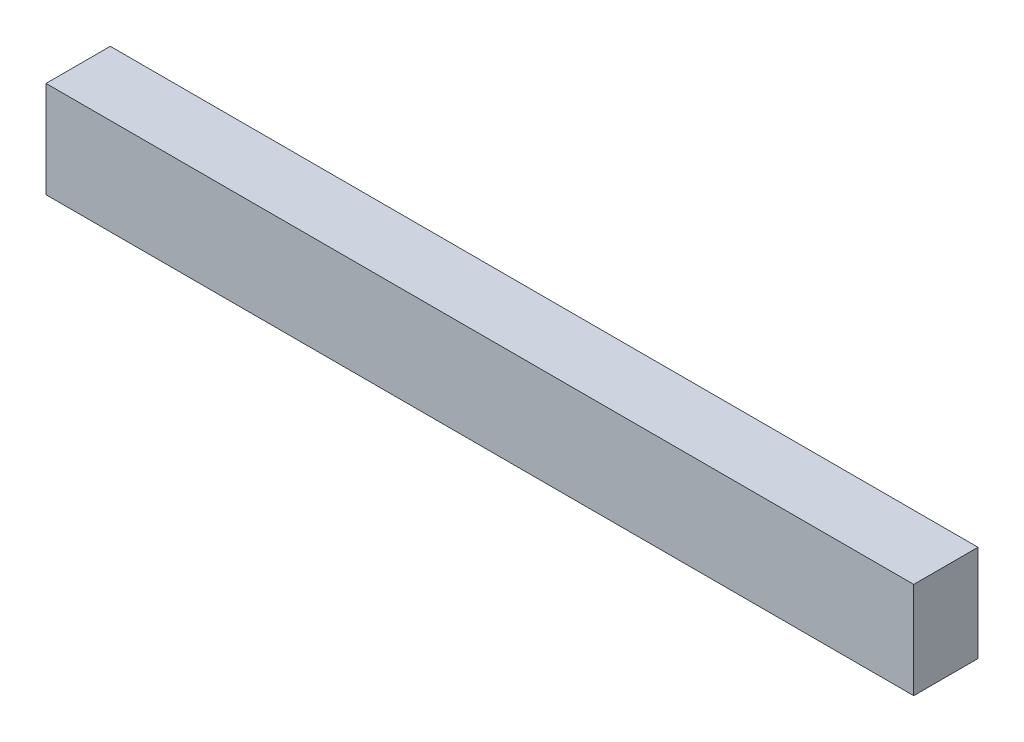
ISO-10303-21;
HEADER;
FILE_DESCRIPTION(('STEP AP214'),'2;1');
FILE_NAME('part.step','',(''),(''),'','','');
FILE_SCHEMA(('AUTOMOTIVE_DESIGN { 1 0 10303 214 1 1 1 1 }'));
ENDSEC;
DATA;
#1=APPLICATION_CONTEXT('core data for automotive mechanical design processes');
#2=APPLICATION_PROTOCOL_DEFINITION('international standard','automotive_design',2000,#1);
#3=PRODUCT_CONTEXT('',#1,'mechanical');
#4=PRODUCT('Part','Part','',(#3));
#5=PRODUCT_RELATED_PRODUCT_CATEGORY('part','',(#4));
#6=PRODUCT_DEFINITION_FORMATION('','',#4);
#7=PRODUCT_DEFINITION_CONTEXT('part definition',#1,'design');
#8=PRODUCT_DEFINITION('design','',#6,#7);
#9=PRODUCT_DEFINITION_SHAPE('','',#8);
#10=(LENGTH_UNIT() NAMED_UNIT(*) SI_UNIT(.MILLI.,.METRE.));
#11=(NAMED_UNIT(*) PLANE_ANGLE_UNIT() SI_UNIT($,.RADIAN.));
#12=(NAMED_UNIT(*) SI_UNIT($,.STERADIAN.) SOLID_ANGLE_UNIT());
#13=UNCERTAINTY_MEASURE_WITH_UNIT(LENGTH_MEASURE(1.E-05),#10,'distance_accuracy_value','');
#14=(GEOMETRIC_REPRESENTATION_CONTEXT(3) GLOBAL_UNCERTAINTY_ASSIGNED_CONTEXT((#13)) GLOBAL_UNIT_ASSIGNED_CONTEXT((#10,
#11,#12)) REPRESENTATION_CONTEXT('',''));
#15=CARTESIAN_POINT('',(0.,0.,0.));
#16=DIRECTION('',(0.,0.,1.));
#17=DIRECTION('',(1.,0.,0.));
#18=AXIS2_PLACEMENT_3D('',#15,#16,#17);
#19=CARTESIAN_POINT('',(270.,0.,0.));
#20=DIRECTION('',(0.,0.,-1.));
#21=DIRECTION('',(-1.,0.,0.));
#22=AXIS2_PLACEMENT_3D('',#19,#20,#21);
#23=PLANE('',#22);
#24=DIRECTION('',(0.,-1.,0.));
#25=VECTOR('',#24,1.);
#26=CARTESIAN_POINT('',(0.,0.,0.));
#27=LINE('',#26,#25);
#28=CARTESIAN_POINT('',(0.,30.,0.));
#29=VERTEX_POINT('',#28);
#30=CARTESIAN_POINT('',(0.,0.,0.));
#31=VERTEX_POINT('',#30);
#32=EDGE_CURVE('E70',#29,#31,#27,.T.);
#33=ORIENTED_EDGE('',*,*,#32,.T.);
#34=DIRECTION('',(-1.,0.,0.));
#35=VECTOR('',#34,1.);
#36=CARTESIAN_POINT('',(270.,0.,0.));
#37=LINE('',#36,#35);
#38=CARTESIAN_POINT('',(270.,0.,0.));
#39=VERTEX_POINT('',#38);
#40=EDGE_CURVE('E11',#39,#31,#37,.T.);
#41=ORIENTED_EDGE('',*,*,#40,.F.);
#42=DIRECTION('',(0.,-1.,0.));
#43=VECTOR('',#42,1.);
#44=CARTESIAN_POINT('',(270.,0.,0.));
#45=LINE('',#44,#43);
#46=CARTESIAN_POINT('',(270.,30.,0.));
#47=VERTEX_POINT('',#46);
#48=EDGE_CURVE('E88',#47,#39,#45,.T.);
#49=ORIENTED_EDGE('',*,*,#48,.F.);
#50=DIRECTION('',(-1.,0.,0.));
#51=VECTOR('',#50,1.);
#52=CARTESIAN_POINT('',(270.,30.,0.));
#53=LINE('',#52,#51);
#54=EDGE_CURVE('E82',#47,#29,#53,.T.);
#55=ORIENTED_EDGE('',*,*,#54,.T.);
#56=EDGE_LOOP('',(#33,#41,#49,#55));
#57=FACE_BOUND('',#56,.T.);
#58=ADVANCED_FACE('F26',(#57),#23,.F.);
#59=CARTESIAN_POINT('',(270.,0.,0.));
#60=DIRECTION('',(0.,1.,0.));
#61=DIRECTION('',(0.,0.,1.));
#62=AXIS2_PLACEMENT_3D('',#59,#60,#61);
#63=PLANE('',#62);
#64=DIRECTION('',(0.,0.,-1.));
#65=VECTOR('',#64,1.);
#66=CARTESIAN_POINT('',(0.,0.,0.));
#67=LINE('',#66,#65);
#68=CARTESIAN_POINT('',(0.,0.,-20.));
#69=VERTEX_POINT('',#68);
#70=EDGE_CURVE('E66',#31,#69,#67,.T.);
#71=ORIENTED_EDGE('',*,*,#70,.T.);
#72=DIRECTION('',(-1.,0.,0.));
#73=VECTOR('',#72,1.);
#74=CARTESIAN_POINT('',(270.,0.,-20.));
#75=LINE('',#74,#73);
#76=CARTESIAN_POINT('',(270.,0.,-20.));
#77=VERTEX_POINT('',#76);
#78=EDGE_CURVE('E33',#77,#69,#75,.T.);
#79=ORIENTED_EDGE('',*,*,#78,.F.);
#80=DIRECTION('',(0.,0.,-1.));
#81=VECTOR('',#80,1.);
#82=CARTESIAN_POINT('',(270.,0.,0.));
#83=LINE('',#82,#81);
#84=EDGE_CURVE('E78',#39,#77,#83,.T.);
#85=ORIENTED_EDGE('',*,*,#84,.F.);
#86=ORIENTED_EDGE('',*,*,#40,.T.);
#87=EDGE_LOOP('',(#71,#79,#85,#86));
#88=FACE_BOUND('',#87,.T.);
#89=ADVANCED_FACE('F77',(#88),#63,.F.);
#90=CARTESIAN_POINT('',(270.,0.,-20.));
#91=DIRECTION('',(0.,0.,1.));
#92=DIRECTION('',(1.,0.,0.));
#93=AXIS2_PLACEMENT_3D('',#90,#91,#92);
#94=PLANE('',#93);
#95=DIRECTION('',(0.,1.,0.));
#96=VECTOR('',#95,1.);
#97=CARTESIAN_POINT('',(0.,0.,-20.));
#98=LINE('',#97,#96);
#99=CARTESIAN_POINT('',(0.,30.,-20.));
#100=VERTEX_POINT('',#99);
#101=EDGE_CURVE('E71',#69,#100,#98,.T.);
#102=ORIENTED_EDGE('',*,*,#101,.T.);
#103=DIRECTION('',(-1.,0.,0.));
#104=VECTOR('',#103,1.);
#105=CARTESIAN_POINT('',(270.,30.,-20.));
#106=LINE('',#105,#104);
#107=CARTESIAN_POINT('',(270.,30.,-20.));
#108=VERTEX_POINT('',#107);
#109=EDGE_CURVE('E94',#108,#100,#106,.T.);
#110=ORIENTED_EDGE('',*,*,#109,.F.);
#111=DIRECTION('',(0.,1.,0.));
#112=VECTOR('',#111,1.);
#113=CARTESIAN_POINT('',(270.,0.,-20.));
#114=LINE('',#113,#112);
#115=EDGE_CURVE('E45',#77,#108,#114,.T.);
#116=ORIENTED_EDGE('',*,*,#115,.F.);
#117=ORIENTED_EDGE('',*,*,#78,.T.);
#118=EDGE_LOOP('',(#102,#110,#116,#117));
#119=FACE_BOUND('',#118,.T.);
#120=ADVANCED_FACE('F97',(#119),#94,.F.);
#121=CARTESIAN_POINT('',(270.,30.,0.));
#122=DIRECTION('',(0.,-1.,0.));
#123=DIRECTION('',(0.,0.,-1.));
#124=AXIS2_PLACEMENT_3D('',#121,#122,#123);
#125=PLANE('',#124);
#126=DIRECTION('',(0.,0.,1.));
#127=VECTOR('',#126,1.);
#128=CARTESIAN_POINT('',(0.,30.,0.));
#129=LINE('',#128,#127);
#130=EDGE_CURVE('E86',#100,#29,#129,.T.);
#131=ORIENTED_EDGE('',*,*,#130,.T.);
#132=ORIENTED_EDGE('',*,*,#54,.F.);
#133=DIRECTION('',(0.,0.,1.));
#134=VECTOR('',#133,1.);
#135=CARTESIAN_POINT('',(270.,30.,0.));
#136=LINE('',#135,#134);
#137=EDGE_CURVE('E40',#108,#47,#136,.T.);
#138=ORIENTED_EDGE('',*,*,#137,.F.);
#139=ORIENTED_EDGE('',*,*,#109,.T.);
#140=EDGE_LOOP('',(#131,#132,#138,#139));
#141=FACE_BOUND('',#140,.T.);
#142=ADVANCED_FACE('F99',(#141),#125,.F.);
#143=CARTESIAN_POINT('',(270.,30.,0.));
#144=DIRECTION('',(-1.,0.,0.));
#145=DIRECTION('',(0.,0.,1.));
#146=AXIS2_PLACEMENT_3D('',#143,#144,#145);
#147=PLANE('',#146);
#148=ORIENTED_EDGE('',*,*,#48,.T.);
#149=ORIENTED_EDGE('',*,*,#84,.T.);
#150=ORIENTED_EDGE('',*,*,#115,.T.);
#151=ORIENTED_EDGE('',*,*,#137,.T.);
#152=EDGE_LOOP('',(#148,#149,#150,#151));
#153=FACE_BOUND('',#152,.T.);
#154=ADVANCED_FACE('F100',(#153),#147,.F.);
#155=CARTESIAN_POINT('',(0.,30.,0.));
#156=DIRECTION('',(-1.,0.,0.));
#157=DIRECTION('',(0.,0.,1.));
#158=AXIS2_PLACEMENT_3D('',#155,#156,#157);
#159=PLANE('',#158);
#160=ORIENTED_EDGE('',*,*,#32,.F.);
#161=ORIENTED_EDGE('',*,*,#130,.F.);
#162=ORIENTED_EDGE('',*,*,#101,.F.);
#163=ORIENTED_EDGE('',*,*,#70,.F.);
#164=EDGE_LOOP('',(#160,#161,#162,#163));
#165=FACE_BOUND('',#164,.T.);
#166=ADVANCED_FACE('F67',(#165),#159,.T.);
#167=CLOSED_SHELL('',(#58,#89,#120,#142,#154,#166));
#168=MANIFOLD_SOLID_BREP('B2',#167);
#169=ADVANCED_BREP_SHAPE_REPRESENTATION('',(#18,#168),#14);
#170=SHAPE_DEFINITION_REPRESENTATION(#9,#169);
ENDSEC;
END-ISO-10303-21;
